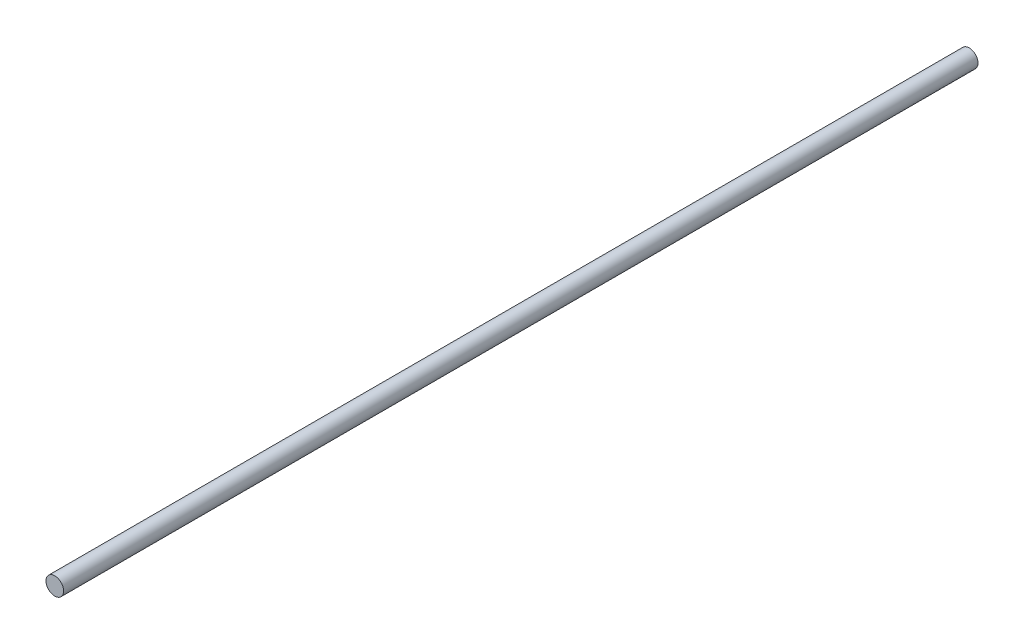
from build123d import *

# Parameters (mm, degrees)
SKETCH_1_R                                 = 4
SCREW_ENVELOPE_D8_LENGTH390_NOTHREAD_DEPTH = 207.5


with BuildPart() as part:
    # Sketch 1 → Screw_Envelope_D8_Length390_NoThread (new, symmetric)
    with BuildSketch(Plane.XY):
        Circle(SKETCH_1_R)
    extrude(amount=SCREW_ENVELOPE_D8_LENGTH390_NOTHREAD_DEPTH, both=True)


solid = part.part
